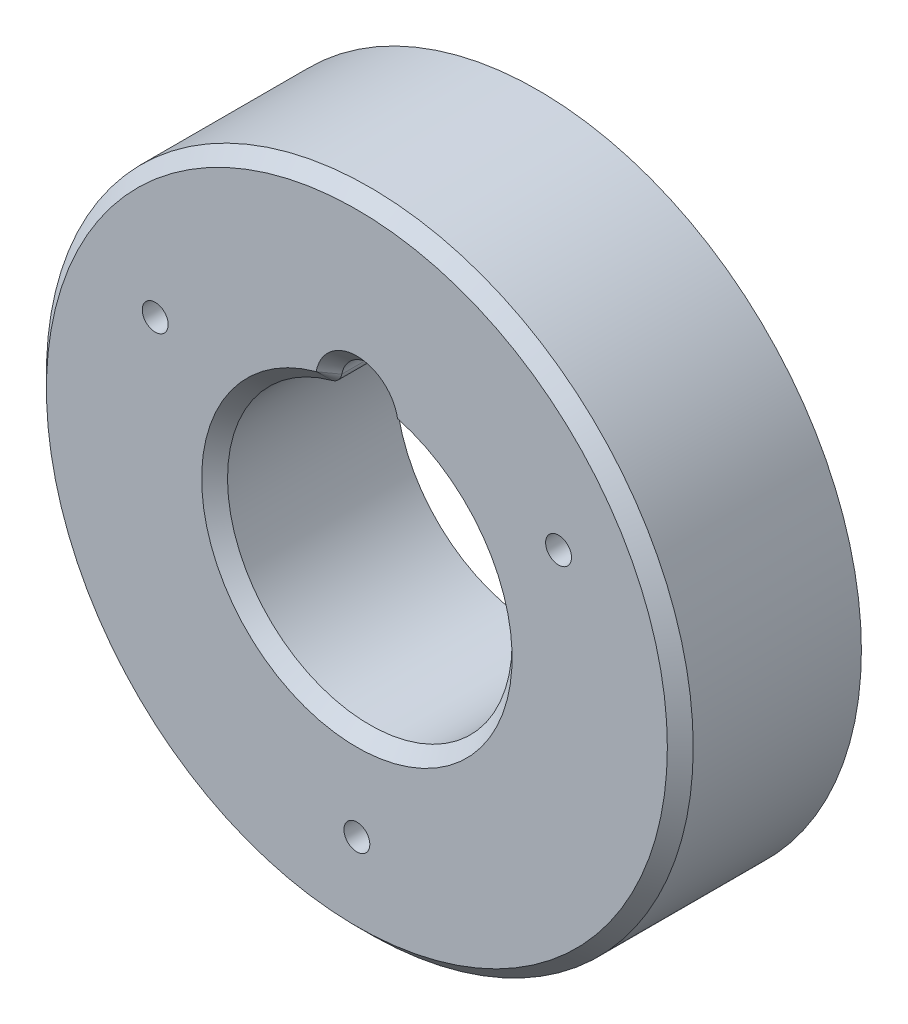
ISO-10303-21;
HEADER;
FILE_DESCRIPTION(('STEP AP214'),'2;1');
FILE_NAME('part.step','',(''),(''),'','','');
FILE_SCHEMA(('AUTOMOTIVE_DESIGN { 1 0 10303 214 1 1 1 1 }'));
ENDSEC;
DATA;
#1=APPLICATION_CONTEXT('core data for automotive mechanical design processes');
#2=APPLICATION_PROTOCOL_DEFINITION('international standard','automotive_design',2000,#1);
#3=PRODUCT_CONTEXT('',#1,'mechanical');
#4=PRODUCT('Part','Part','',(#3));
#5=PRODUCT_RELATED_PRODUCT_CATEGORY('part','',(#4));
#6=PRODUCT_DEFINITION_FORMATION('','',#4);
#7=PRODUCT_DEFINITION_CONTEXT('part definition',#1,'design');
#8=PRODUCT_DEFINITION('design','',#6,#7);
#9=PRODUCT_DEFINITION_SHAPE('','',#8);
#10=(LENGTH_UNIT() NAMED_UNIT(*) SI_UNIT(.MILLI.,.METRE.));
#11=(NAMED_UNIT(*) PLANE_ANGLE_UNIT() SI_UNIT($,.RADIAN.));
#12=(NAMED_UNIT(*) SI_UNIT($,.STERADIAN.) SOLID_ANGLE_UNIT());
#13=UNCERTAINTY_MEASURE_WITH_UNIT(LENGTH_MEASURE(1.E-05),#10,'distance_accuracy_value','');
#14=(GEOMETRIC_REPRESENTATION_CONTEXT(3) GLOBAL_UNCERTAINTY_ASSIGNED_CONTEXT((#13)) GLOBAL_UNIT_ASSIGNED_CONTEXT((#10,
#11,#12)) REPRESENTATION_CONTEXT('',''));
#15=CARTESIAN_POINT('',(0.,0.,0.));
#16=DIRECTION('',(0.,0.,1.));
#17=DIRECTION('',(1.,0.,0.));
#18=AXIS2_PLACEMENT_3D('',#15,#16,#17);
#19=CARTESIAN_POINT('',(0.,0.,7.));
#20=DIRECTION('',(0.,0.,1.));
#21=DIRECTION('',(1.,0.,0.));
#22=AXIS2_PLACEMENT_3D('',#19,#20,#21);
#23=PLANE('',#22);
#24=CARTESIAN_POINT('',(-7.79422863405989,4.50000000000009,7.));
#25=DIRECTION('',(0.,0.,1.));
#26=DIRECTION('',(-0.499999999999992,0.866025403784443,0.));
#27=AXIS2_PLACEMENT_3D('',#24,#25,#26);
#28=CIRCLE('',#27,0.5);
#29=CARTESIAN_POINT('',(-8.04422863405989,4.93301270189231,7.));
#30=VERTEX_POINT('',#29);
#31=EDGE_CURVE('E273',#30,#30,#28,.T.);
#32=ORIENTED_EDGE('',*,*,#31,.F.);
#33=EDGE_LOOP('',(#32));
#34=FACE_BOUND('',#33,.T.);
#35=CARTESIAN_POINT('',(0.,-9.,7.));
#36=DIRECTION('',(0.,0.,1.));
#37=DIRECTION('',(-0.500000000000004,-0.866025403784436,0.));
#38=AXIS2_PLACEMENT_3D('',#35,#36,#37);
#39=CIRCLE('',#38,0.5);
#40=CARTESIAN_POINT('',(-0.250000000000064,-9.43301270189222,7.));
#41=VERTEX_POINT('',#40);
#42=EDGE_CURVE('E267',#41,#41,#39,.T.);
#43=ORIENTED_EDGE('',*,*,#42,.F.);
#44=EDGE_LOOP('',(#43));
#45=FACE_BOUND('',#44,.T.);
#46=CARTESIAN_POINT('',(7.79422863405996,4.49999999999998,7.));
#47=DIRECTION('',(0.,0.,1.));
#48=DIRECTION('',(1.,0.,0.));
#49=AXIS2_PLACEMENT_3D('',#46,#47,#48);
#50=CIRCLE('',#49,0.5);
#51=CARTESIAN_POINT('',(8.29422863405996,4.49999999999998,7.));
#52=VERTEX_POINT('',#51);
#53=EDGE_CURVE('E262',#52,#52,#50,.T.);
#54=ORIENTED_EDGE('',*,*,#53,.F.);
#55=EDGE_LOOP('',(#54));
#56=FACE_BOUND('',#55,.T.);
#57=CARTESIAN_POINT('',(0.,0.,7.));
#58=DIRECTION('',(0.,0.,1.));
#59=DIRECTION('',(1.,0.,0.));
#60=AXIS2_PLACEMENT_3D('',#57,#58,#59);
#61=CIRCLE('',#60,6.);
#62=CARTESIAN_POINT('',(1.5734992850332,5.79,7.));
#63=VERTEX_POINT('',#62);
#64=CARTESIAN_POINT('',(-1.5734992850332,5.79,7.));
#65=VERTEX_POINT('',#64);
#66=EDGE_CURVE('E114',#63,#65,#61,.F.);
#67=ORIENTED_EDGE('',*,*,#66,.T.);
#68=CARTESIAN_POINT('',(0.,5.5,7.));
#69=DIRECTION('',(0.,0.,1.));
#70=DIRECTION('',(1.,0.,0.));
#71=AXIS2_PLACEMENT_3D('',#68,#69,#70);
#72=CIRCLE('',#71,1.6);
#73=EDGE_CURVE('E116',#65,#63,#72,.F.);
#74=ORIENTED_EDGE('',*,*,#73,.T.);
#75=EDGE_LOOP('',(#67,#74));
#76=FACE_BOUND('',#75,.T.);
#77=CARTESIAN_POINT('',(0.,0.,7.));
#78=DIRECTION('',(0.,0.,1.));
#79=DIRECTION('',(1.,0.,0.));
#80=AXIS2_PLACEMENT_3D('',#77,#78,#79);
#81=CIRCLE('',#80,12.);
#82=CARTESIAN_POINT('',(12.,0.,7.));
#83=VERTEX_POINT('',#82);
#84=EDGE_CURVE('E148',#83,#83,#81,.T.);
#85=ORIENTED_EDGE('',*,*,#84,.T.);
#86=EDGE_LOOP('',(#85));
#87=FACE_BOUND('',#86,.T.);
#88=ADVANCED_FACE('F31',(#34,#45,#56,#76,#87),#23,.T.);
#89=CARTESIAN_POINT('',(0.,0.,0.));
#90=DIRECTION('',(0.,0.,1.));
#91=DIRECTION('',(1.,0.,0.));
#92=AXIS2_PLACEMENT_3D('',#89,#90,#91);
#93=PLANE('',#92);
#94=CARTESIAN_POINT('',(-7.79422863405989,4.50000000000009,0.));
#95=DIRECTION('',(0.,0.,1.));
#96=DIRECTION('',(-0.499999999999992,0.866025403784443,0.));
#97=AXIS2_PLACEMENT_3D('',#94,#95,#96);
#98=CIRCLE('',#97,0.5);
#99=CARTESIAN_POINT('',(-8.04422863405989,4.93301270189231,0.));
#100=VERTEX_POINT('',#99);
#101=EDGE_CURVE('E271',#100,#100,#98,.T.);
#102=ORIENTED_EDGE('',*,*,#101,.T.);
#103=EDGE_LOOP('',(#102));
#104=FACE_BOUND('',#103,.T.);
#105=CARTESIAN_POINT('',(0.,-9.,0.));
#106=DIRECTION('',(0.,0.,1.));
#107=DIRECTION('',(-0.500000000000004,-0.866025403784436,0.));
#108=AXIS2_PLACEMENT_3D('',#105,#106,#107);
#109=CIRCLE('',#108,0.5);
#110=CARTESIAN_POINT('',(-0.250000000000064,-9.43301270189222,0.));
#111=VERTEX_POINT('',#110);
#112=EDGE_CURVE('E264',#111,#111,#109,.T.);
#113=ORIENTED_EDGE('',*,*,#112,.T.);
#114=EDGE_LOOP('',(#113));
#115=FACE_BOUND('',#114,.T.);
#116=CARTESIAN_POINT('',(7.79422863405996,4.49999999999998,0.));
#117=DIRECTION('',(0.,0.,1.));
#118=DIRECTION('',(1.,0.,0.));
#119=AXIS2_PLACEMENT_3D('',#116,#117,#118);
#120=CIRCLE('',#119,0.5);
#121=CARTESIAN_POINT('',(8.29422863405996,4.49999999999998,0.));
#122=VERTEX_POINT('',#121);
#123=EDGE_CURVE('E124',#122,#122,#120,.T.);
#124=ORIENTED_EDGE('',*,*,#123,.T.);
#125=EDGE_LOOP('',(#124));
#126=FACE_BOUND('',#125,.T.);
#127=CARTESIAN_POINT('',(0.,0.,0.));
#128=DIRECTION('',(0.,0.,1.));
#129=DIRECTION('',(1.,0.,0.));
#130=AXIS2_PLACEMENT_3D('',#127,#128,#129);
#131=CIRCLE('',#130,12.5);
#132=CARTESIAN_POINT('',(12.5,0.,0.));
#133=VERTEX_POINT('',#132);
#134=EDGE_CURVE('E145',#133,#133,#131,.T.);
#135=ORIENTED_EDGE('',*,*,#134,.F.);
#136=EDGE_LOOP('',(#135));
#137=FACE_BOUND('',#136,.T.);
#138=CARTESIAN_POINT('',(0.,0.,0.));
#139=DIRECTION('',(0.,0.,1.));
#140=DIRECTION('',(1.,0.,0.));
#141=AXIS2_PLACEMENT_3D('',#138,#139,#140);
#142=CIRCLE('',#141,5.5);
#143=CARTESIAN_POINT('',(-1.44237434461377,5.3075,0.));
#144=VERTEX_POINT('',#143);
#145=CARTESIAN_POINT('',(1.44237434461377,5.3075,0.));
#146=VERTEX_POINT('',#145);
#147=EDGE_CURVE('E86',#144,#146,#142,.T.);
#148=ORIENTED_EDGE('',*,*,#147,.T.);
#149=CARTESIAN_POINT('',(1.5734992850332,5.79,0.));
#150=DIRECTION('',(0.,0.,1.));
#151=DIRECTION('',(1.,0.,0.));
#152=AXIS2_PLACEMENT_3D('',#149,#150,#151);
#153=CIRCLE('',#152,0.5);
#154=CARTESIAN_POINT('',(1.08178075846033,5.699375,0.));
#155=VERTEX_POINT('',#154);
#156=EDGE_CURVE('E81',#146,#155,#153,.F.);
#157=ORIENTED_EDGE('',*,*,#156,.T.);
#158=CARTESIAN_POINT('',(0.,5.5,0.));
#159=DIRECTION('',(0.,0.,1.));
#160=DIRECTION('',(1.,0.,0.));
#161=AXIS2_PLACEMENT_3D('',#158,#159,#160);
#162=CIRCLE('',#161,1.1);
#163=CARTESIAN_POINT('',(-1.08178075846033,5.699375,0.));
#164=VERTEX_POINT('',#163);
#165=EDGE_CURVE('E84',#155,#164,#162,.T.);
#166=ORIENTED_EDGE('',*,*,#165,.T.);
#167=CARTESIAN_POINT('',(-1.5734992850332,5.79,0.));
#168=DIRECTION('',(0.,0.,1.));
#169=DIRECTION('',(1.,0.,0.));
#170=AXIS2_PLACEMENT_3D('',#167,#168,#169);
#171=CIRCLE('',#170,0.5);
#172=EDGE_CURVE('E90',#164,#144,#171,.F.);
#173=ORIENTED_EDGE('',*,*,#172,.T.);
#174=EDGE_LOOP('',(#148,#157,#166,#173));
#175=FACE_BOUND('',#174,.T.);
#176=ADVANCED_FACE('F83',(#104,#115,#126,#137,#175),#93,.F.);
#177=CARTESIAN_POINT('',(0.,0.,7.));
#178=DIRECTION('',(0.,0.,-1.));
#179=DIRECTION('',(-1.,0.,0.));
#180=AXIS2_PLACEMENT_3D('',#177,#178,#179);
#181=CYLINDRICAL_SURFACE('',#180,12.5);
#182=CARTESIAN_POINT('',(0.,0.,6.5));
#183=DIRECTION('',(0.,0.,1.));
#184=DIRECTION('',(1.,0.,0.));
#185=AXIS2_PLACEMENT_3D('',#182,#183,#184);
#186=CIRCLE('',#185,12.5);
#187=CARTESIAN_POINT('',(12.5,0.,6.5));
#188=VERTEX_POINT('',#187);
#189=EDGE_CURVE('E107',#188,#188,#186,.F.);
#190=ORIENTED_EDGE('',*,*,#189,.T.);
#191=EDGE_LOOP('',(#190));
#192=FACE_BOUND('',#191,.T.);
#193=ORIENTED_EDGE('',*,*,#134,.T.);
#194=EDGE_LOOP('',(#193));
#195=FACE_BOUND('',#194,.T.);
#196=ADVANCED_FACE('F156',(#192,#195),#181,.T.);
#197=CARTESIAN_POINT('',(0.,0.,7.));
#198=DIRECTION('',(0.,0.,-1.));
#199=DIRECTION('',(-1.,0.,0.));
#200=AXIS2_PLACEMENT_3D('',#197,#198,#199);
#201=CYLINDRICAL_SURFACE('',#200,5.5);
#202=DIRECTION('',(0.,0.,-1.));
#203=VECTOR('',#202,1.);
#204=CARTESIAN_POINT('',(-1.44237434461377,5.3075,7.));
#205=LINE('',#204,#203);
#206=CARTESIAN_POINT('',(-1.44237434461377,5.3075,6.5));
#207=VERTEX_POINT('',#206);
#208=EDGE_CURVE('E103',#144,#207,#205,.F.);
#209=ORIENTED_EDGE('',*,*,#208,.T.);
#210=CARTESIAN_POINT('',(0.,0.,6.5));
#211=DIRECTION('',(0.,0.,1.));
#212=DIRECTION('',(1.,0.,0.));
#213=AXIS2_PLACEMENT_3D('',#210,#211,#212);
#214=CIRCLE('',#213,5.5);
#215=CARTESIAN_POINT('',(1.44237434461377,5.3075,6.5));
#216=VERTEX_POINT('',#215);
#217=EDGE_CURVE('E11',#207,#216,#214,.T.);
#218=ORIENTED_EDGE('',*,*,#217,.T.);
#219=DIRECTION('',(0.,0.,-1.));
#220=VECTOR('',#219,1.);
#221=CARTESIAN_POINT('',(1.44237434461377,5.3075,7.));
#222=LINE('',#221,#220);
#223=EDGE_CURVE('E105',#216,#146,#222,.T.);
#224=ORIENTED_EDGE('',*,*,#223,.T.);
#225=ORIENTED_EDGE('',*,*,#147,.F.);
#226=EDGE_LOOP('',(#209,#218,#224,#225));
#227=FACE_BOUND('',#226,.T.);
#228=ADVANCED_FACE('F144',(#227),#201,.F.);
#229=CARTESIAN_POINT('',(0.,0.,7.));
#230=DIRECTION('',(0.,0.,-1.));
#231=DIRECTION('',(-1.,0.,0.));
#232=AXIS2_PLACEMENT_3D('',#229,#230,#231);
#233=CONICAL_SURFACE('',#232,12.,0.785398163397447);
#234=ORIENTED_EDGE('',*,*,#189,.F.);
#235=EDGE_LOOP('',(#234));
#236=FACE_BOUND('',#235,.T.);
#237=ORIENTED_EDGE('',*,*,#84,.F.);
#238=EDGE_LOOP('',(#237));
#239=FACE_BOUND('',#238,.T.);
#240=ADVANCED_FACE('F159',(#236,#239),#233,.T.);
#241=CARTESIAN_POINT('',(0.,5.5,0.));
#242=DIRECTION('',(0.,0.,1.));
#243=DIRECTION('',(1.,0.,0.));
#244=AXIS2_PLACEMENT_3D('',#241,#242,#243);
#245=CYLINDRICAL_SURFACE('',#244,1.1);
#246=DIRECTION('',(0.,0.,1.));
#247=VECTOR('',#246,1.);
#248=CARTESIAN_POINT('',(1.08178075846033,5.699375,0.));
#249=LINE('',#248,#247);
#250=CARTESIAN_POINT('',(1.08178075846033,5.699375,6.5));
#251=VERTEX_POINT('',#250);
#252=EDGE_CURVE('E96',#155,#251,#249,.T.);
#253=ORIENTED_EDGE('',*,*,#252,.T.);
#254=CARTESIAN_POINT('',(0.,5.5,6.5));
#255=DIRECTION('',(0.,0.,1.));
#256=DIRECTION('',(1.,0.,0.));
#257=AXIS2_PLACEMENT_3D('',#254,#255,#256);
#258=CIRCLE('',#257,1.1);
#259=CARTESIAN_POINT('',(-1.08178075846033,5.699375,6.5));
#260=VERTEX_POINT('',#259);
#261=EDGE_CURVE('E89',#251,#260,#258,.T.);
#262=ORIENTED_EDGE('',*,*,#261,.T.);
#263=DIRECTION('',(0.,0.,1.));
#264=VECTOR('',#263,1.);
#265=CARTESIAN_POINT('',(-1.08178075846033,5.699375,0.));
#266=LINE('',#265,#264);
#267=EDGE_CURVE('E98',#260,#164,#266,.F.);
#268=ORIENTED_EDGE('',*,*,#267,.T.);
#269=ORIENTED_EDGE('',*,*,#165,.F.);
#270=EDGE_LOOP('',(#253,#262,#268,#269));
#271=FACE_BOUND('',#270,.T.);
#272=ADVANCED_FACE('F94',(#271),#245,.F.);
#273=CARTESIAN_POINT('',(1.5734992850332,5.79,7.));
#274=DIRECTION('',(0.,0.,1.));
#275=DIRECTION('',(1.,0.,0.));
#276=AXIS2_PLACEMENT_3D('',#273,#274,#275);
#277=CYLINDRICAL_SURFACE('',#276,0.5);
#278=ORIENTED_EDGE('',*,*,#223,.F.);
#279=CARTESIAN_POINT('',(1.5734992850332,5.79,6.5));
#280=DIRECTION('',(0.,0.,1.));
#281=DIRECTION('',(1.,0.,0.));
#282=AXIS2_PLACEMENT_3D('',#279,#280,#281);
#283=CIRCLE('',#282,0.5);
#284=EDGE_CURVE('E40',#216,#251,#283,.F.);
#285=ORIENTED_EDGE('',*,*,#284,.T.);
#286=ORIENTED_EDGE('',*,*,#252,.F.);
#287=ORIENTED_EDGE('',*,*,#156,.F.);
#288=EDGE_LOOP('',(#278,#285,#286,#287));
#289=FACE_BOUND('',#288,.T.);
#290=ADVANCED_FACE('F101',(#289),#277,.T.);
#291=CARTESIAN_POINT('',(-1.5734992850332,5.79,7.));
#292=DIRECTION('',(0.,0.,-1.));
#293=DIRECTION('',(-1.,0.,0.));
#294=AXIS2_PLACEMENT_3D('',#291,#292,#293);
#295=CYLINDRICAL_SURFACE('',#294,0.5);
#296=ORIENTED_EDGE('',*,*,#267,.F.);
#297=CARTESIAN_POINT('',(-1.5734992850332,5.79,6.5));
#298=DIRECTION('',(0.,0.,1.));
#299=DIRECTION('',(1.,0.,0.));
#300=AXIS2_PLACEMENT_3D('',#297,#298,#299);
#301=CIRCLE('',#300,0.5);
#302=EDGE_CURVE('E54',#260,#207,#301,.F.);
#303=ORIENTED_EDGE('',*,*,#302,.T.);
#304=ORIENTED_EDGE('',*,*,#208,.F.);
#305=ORIENTED_EDGE('',*,*,#172,.F.);
#306=EDGE_LOOP('',(#296,#303,#304,#305));
#307=FACE_BOUND('',#306,.T.);
#308=ADVANCED_FACE('F143',(#307),#295,.T.);
#309=CARTESIAN_POINT('',(0.,0.,6.5));
#310=DIRECTION('',(0.,0.,1.));
#311=DIRECTION('',(1.,0.,0.));
#312=AXIS2_PLACEMENT_3D('',#309,#310,#311);
#313=CONICAL_SURFACE('',#312,5.5,0.785398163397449);
#314=DIRECTION('',(0.185438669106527,0.682358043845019,0.707106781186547));
#315=VECTOR('',#314,1.);
#316=CARTESIAN_POINT('',(1.44237434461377,5.3075,6.5));
#317=LINE('',#316,#315);
#318=EDGE_CURVE('E35',#216,#63,#317,.T.);
#319=ORIENTED_EDGE('',*,*,#318,.F.);
#320=ORIENTED_EDGE('',*,*,#217,.F.);
#321=DIRECTION('',(0.185438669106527,-0.682358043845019,-0.707106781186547));
#322=VECTOR('',#321,1.);
#323=CARTESIAN_POINT('',(-1.5734992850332,5.79,7.));
#324=LINE('',#323,#322);
#325=EDGE_CURVE('E125',#65,#207,#324,.T.);
#326=ORIENTED_EDGE('',*,*,#325,.F.);
#327=ORIENTED_EDGE('',*,*,#66,.F.);
#328=EDGE_LOOP('',(#319,#320,#326,#327));
#329=FACE_BOUND('',#328,.T.);
#330=ADVANCED_FACE('F33',(#329),#313,.F.);
#331=CARTESIAN_POINT('',(1.5734992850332,5.79,6.5));
#332=DIRECTION('',(0.,0.,-1.));
#333=DIRECTION('',(-1.,0.,0.));
#334=AXIS2_PLACEMENT_3D('',#331,#332,#333);
#335=CONICAL_SURFACE('',#334,0.500000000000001,0.785398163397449);
#336=ORIENTED_EDGE('',*,*,#284,.F.);
#337=ORIENTED_EDGE('',*,*,#318,.T.);
#338=DIRECTION('',(0.695395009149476,0.128163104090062,0.707106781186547));
#339=VECTOR('',#338,1.);
#340=CARTESIAN_POINT('',(1.08178075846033,5.699375,6.5));
#341=LINE('',#340,#339);
#342=EDGE_CURVE('E123',#251,#63,#341,.T.);
#343=ORIENTED_EDGE('',*,*,#342,.F.);
#344=EDGE_LOOP('',(#336,#337,#343));
#345=FACE_BOUND('',#344,.T.);
#346=ADVANCED_FACE('F134',(#345),#335,.T.);
#347=CARTESIAN_POINT('',(-1.5734992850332,5.79,6.5));
#348=DIRECTION('',(0.,0.,-1.));
#349=DIRECTION('',(-1.,0.,0.));
#350=AXIS2_PLACEMENT_3D('',#347,#348,#349);
#351=CONICAL_SURFACE('',#350,0.500000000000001,0.785398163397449);
#352=ORIENTED_EDGE('',*,*,#325,.T.);
#353=ORIENTED_EDGE('',*,*,#302,.F.);
#354=DIRECTION('',(0.695395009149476,-0.128163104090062,-0.707106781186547));
#355=VECTOR('',#354,1.);
#356=CARTESIAN_POINT('',(-1.5734992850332,5.79,7.));
#357=LINE('',#356,#355);
#358=EDGE_CURVE('E121',#65,#260,#357,.T.);
#359=ORIENTED_EDGE('',*,*,#358,.F.);
#360=EDGE_LOOP('',(#352,#353,#359));
#361=FACE_BOUND('',#360,.T.);
#362=ADVANCED_FACE('F142',(#361),#351,.T.);
#363=CARTESIAN_POINT('',(0.,5.5,6.5));
#364=DIRECTION('',(0.,0.,1.));
#365=DIRECTION('',(1.,0.,0.));
#366=AXIS2_PLACEMENT_3D('',#363,#364,#365);
#367=CONICAL_SURFACE('',#366,1.1,0.785398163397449);
#368=ORIENTED_EDGE('',*,*,#342,.T.);
#369=ORIENTED_EDGE('',*,*,#73,.F.);
#370=ORIENTED_EDGE('',*,*,#358,.T.);
#371=ORIENTED_EDGE('',*,*,#261,.F.);
#372=EDGE_LOOP('',(#368,#369,#370,#371));
#373=FACE_BOUND('',#372,.T.);
#374=ADVANCED_FACE('F141',(#373),#367,.F.);
#375=CARTESIAN_POINT('',(7.79422863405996,4.49999999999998,0.));
#376=DIRECTION('',(0.,0.,1.));
#377=DIRECTION('',(1.,0.,0.));
#378=AXIS2_PLACEMENT_3D('',#375,#376,#377);
#379=CYLINDRICAL_SURFACE('',#378,0.5);
#380=ORIENTED_EDGE('',*,*,#123,.F.);
#381=EDGE_LOOP('',(#380));
#382=FACE_BOUND('',#381,.T.);
#383=ORIENTED_EDGE('',*,*,#53,.T.);
#384=EDGE_LOOP('',(#383));
#385=FACE_BOUND('',#384,.T.);
#386=ADVANCED_FACE('F185',(#382,#385),#379,.F.);
#387=CARTESIAN_POINT('',(0.,-9.,0.));
#388=DIRECTION('',(0.,0.,1.));
#389=DIRECTION('',(1.,0.,0.));
#390=AXIS2_PLACEMENT_3D('',#387,#388,#389);
#391=CYLINDRICAL_SURFACE('',#390,0.5);
#392=ORIENTED_EDGE('',*,*,#112,.F.);
#393=EDGE_LOOP('',(#392));
#394=FACE_BOUND('',#393,.T.);
#395=ORIENTED_EDGE('',*,*,#42,.T.);
#396=EDGE_LOOP('',(#395));
#397=FACE_BOUND('',#396,.T.);
#398=ADVANCED_FACE('F231',(#394,#397),#391,.F.);
#399=CARTESIAN_POINT('',(-7.79422863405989,4.50000000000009,0.));
#400=DIRECTION('',(0.,0.,1.));
#401=DIRECTION('',(1.,0.,0.));
#402=AXIS2_PLACEMENT_3D('',#399,#400,#401);
#403=CYLINDRICAL_SURFACE('',#402,0.5);
#404=ORIENTED_EDGE('',*,*,#101,.F.);
#405=EDGE_LOOP('',(#404));
#406=FACE_BOUND('',#405,.T.);
#407=ORIENTED_EDGE('',*,*,#31,.T.);
#408=EDGE_LOOP('',(#407));
#409=FACE_BOUND('',#408,.T.);
#410=ADVANCED_FACE('F236',(#406,#409),#403,.F.);
#411=CLOSED_SHELL('',(#88,#176,#196,#228,#240,#272,#290,#308,#330,#346,#362,#374,#386,#398,#410));
#412=MANIFOLD_SOLID_BREP('B2',#411);
#413=ADVANCED_BREP_SHAPE_REPRESENTATION('',(#18,#412),#14);
#414=SHAPE_DEFINITION_REPRESENTATION(#9,#413);
ENDSEC;
END-ISO-10303-21;
